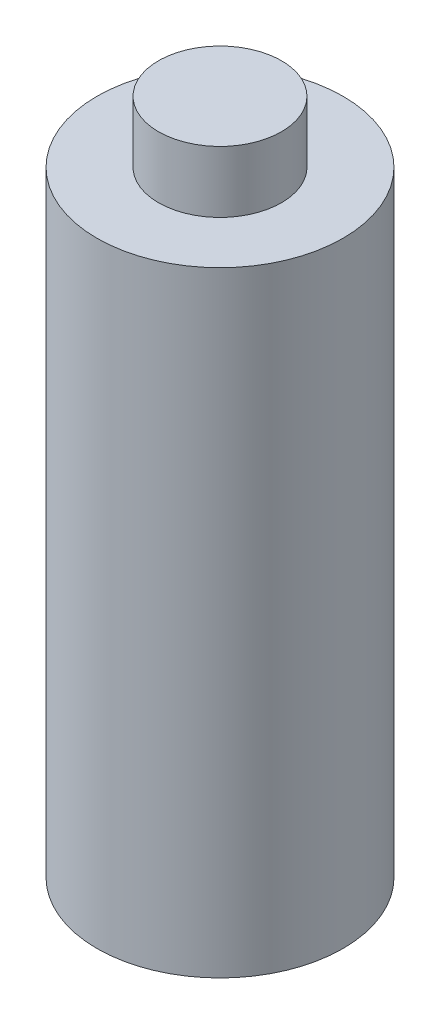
from build123d import *

# Parameters (mm, degrees)
ESQUISSE1_R        = 40
BOSS_EXTRU_1_DEPTH = 200
ESQUISSE2_R        = 20
BOSS_EXTRU_2_DEPTH = 20


with BuildPart() as part:
    # Esquisse1 → Boss.-Extru.1 (new body)
    with BuildSketch(Plane(origin=(0, 0, 0), x_dir=(1, 0, 0), z_dir=(0, 1, 0))):
        with Locations(Location((0, 0, 0), (0, 0, 270))):
            Circle(ESQUISSE1_R)
    extrude(amount=BOSS_EXTRU_1_DEPTH)

    # Esquisse2 → Boss.-Extru.2 (add)
    with BuildSketch(Plane(origin=(0, 200, 0), x_dir=(1, 0, 0), z_dir=(0, 1, 0))):
        with Locations(Location((0, 0, 0), (0, 0, 270))):
            Circle(ESQUISSE2_R)
    extrude(amount=BOSS_EXTRU_2_DEPTH)


solid = part.part
